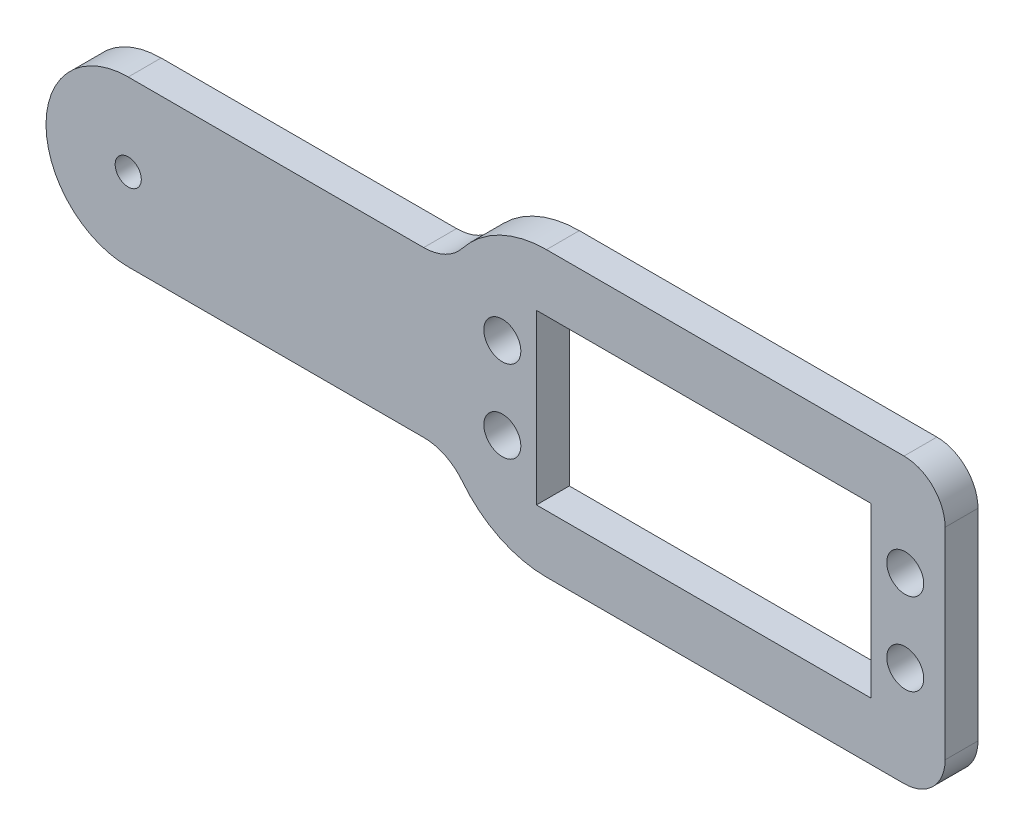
from build123d import *

# Parameters (mm, degrees)
SKETCH1_R           = 1.59
SKETCH1_R_2         = 2.25
SKETCH1_W           = 40.7
SKETCH1_H           = 20.5
BOSS_EXTRUDE1_DEPTH = 4


with BuildPart() as part:
    # Sketch1 → Boss-Extrude1 (new body)
    with BuildSketch(Plane.XY):
        with BuildLine():
            Line((29.35, -12.25), (29.35, 12.25))
            ThreePointArc((29.35, 12.25), (27.885533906, 15.785533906), (24.35, 17.25))
            Line((24.35, 17.25), (-19.133989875, 17.25))
            ThreePointArc((-19.133989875, 17.25), (-24.812318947, 15.944296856), (-29.35, 12.289473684))
            ThreePointArc((-29.35, 12.289473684), (-31.444314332, 10.60263222), (-34.065081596, 10))
            Line((-34.065081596, 10), (-70, 10))
            ThreePointArc((-70, 10), (-80, 0), (-70, -10))
            Line((-70, -10), (-34.065081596, -10))
            ThreePointArc((-34.065081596, -10), (-31.444314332, -10.60263222), (-29.35, -12.289473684))
            ThreePointArc((-29.35, -12.289473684), (-24.812318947, -15.944296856), (-19.133989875, -17.25))
            Line((-19.133989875, -17.25), (24.35, -17.25))
            ThreePointArc((24.35, -17.25), (27.885533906, -15.785533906), (29.35, -12.25))
        make_face()
        with Locations((-70, 0)):
            Circle(SKETCH1_R, mode=Mode.SUBTRACT)
        with Locations((-24.5, -5)):
            Circle(SKETCH1_R_2, mode=Mode.SUBTRACT)
        with Locations((24.5, -5)):
            Circle(SKETCH1_R_2, mode=Mode.SUBTRACT)
        with Locations((24.5, 5)):
            Circle(SKETCH1_R_2, mode=Mode.SUBTRACT)
        with Locations((-24.5, 5)):
            Circle(SKETCH1_R_2, mode=Mode.SUBTRACT)
        Rectangle(SKETCH1_W, SKETCH1_H, mode=Mode.SUBTRACT)
    extrude(amount=BOSS_EXTRUDE1_DEPTH)


solid = part.part
